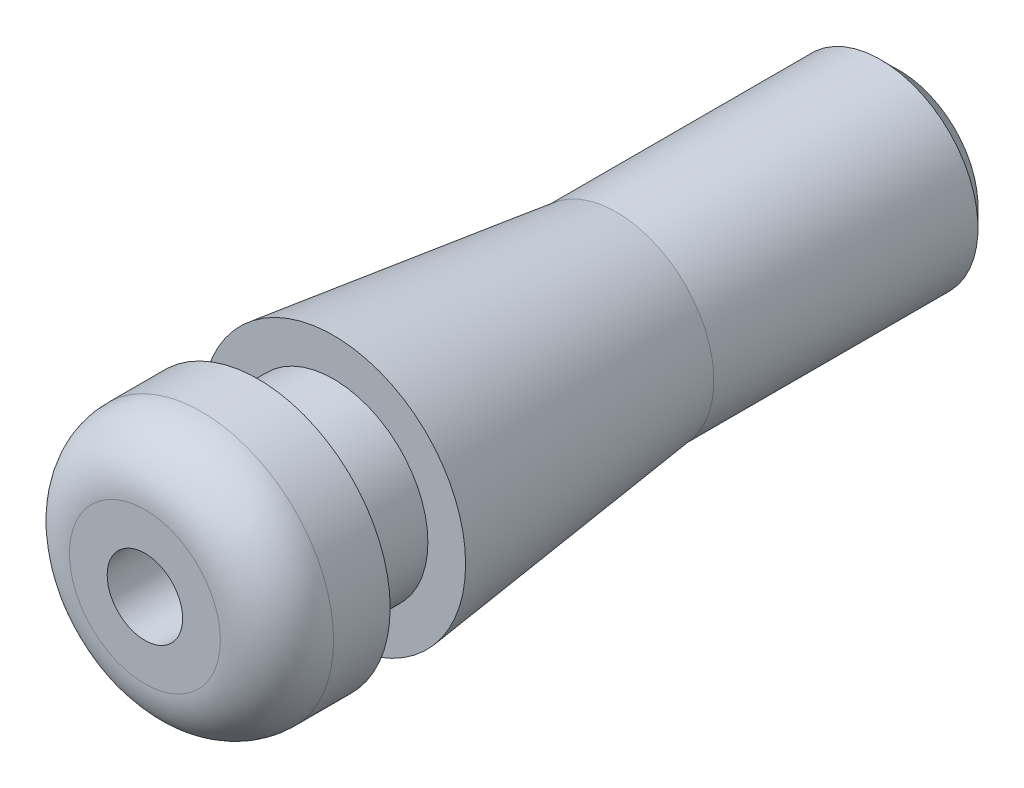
ISO-10303-21;
HEADER;
FILE_DESCRIPTION(('STEP AP214'),'2;1');
FILE_NAME('part.step','',(''),(''),'','','');
FILE_SCHEMA(('AUTOMOTIVE_DESIGN { 1 0 10303 214 1 1 1 1 }'));
ENDSEC;
DATA;
#1=APPLICATION_CONTEXT('core data for automotive mechanical design processes');
#2=APPLICATION_PROTOCOL_DEFINITION('international standard','automotive_design',2000,#1);
#3=PRODUCT_CONTEXT('',#1,'mechanical');
#4=PRODUCT('Part','Part','',(#3));
#5=PRODUCT_RELATED_PRODUCT_CATEGORY('part','',(#4));
#6=PRODUCT_DEFINITION_FORMATION('','',#4);
#7=PRODUCT_DEFINITION_CONTEXT('part definition',#1,'design');
#8=PRODUCT_DEFINITION('design','',#6,#7);
#9=PRODUCT_DEFINITION_SHAPE('','',#8);
#10=(LENGTH_UNIT() NAMED_UNIT(*) SI_UNIT(.MILLI.,.METRE.));
#11=(NAMED_UNIT(*) PLANE_ANGLE_UNIT() SI_UNIT($,.RADIAN.));
#12=(NAMED_UNIT(*) SI_UNIT($,.STERADIAN.) SOLID_ANGLE_UNIT());
#13=UNCERTAINTY_MEASURE_WITH_UNIT(LENGTH_MEASURE(1.E-05),#10,'distance_accuracy_value','');
#14=(GEOMETRIC_REPRESENTATION_CONTEXT(3) GLOBAL_UNCERTAINTY_ASSIGNED_CONTEXT((#13)) GLOBAL_UNIT_ASSIGNED_CONTEXT((#10,
#11,#12)) REPRESENTATION_CONTEXT('',''));
#15=CARTESIAN_POINT('',(0.,0.,0.));
#16=DIRECTION('',(0.,0.,1.));
#17=DIRECTION('',(1.,0.,0.));
#18=AXIS2_PLACEMENT_3D('',#15,#16,#17);
#19=CARTESIAN_POINT('',(0.,0.,4.));
#20=DIRECTION('',(0.,0.,-1.));
#21=DIRECTION('',(-1.,0.,0.));
#22=AXIS2_PLACEMENT_3D('',#19,#20,#21);
#23=CYLINDRICAL_SURFACE('',#22,5.);
#24=CARTESIAN_POINT('',(0.,0.,4.));
#25=DIRECTION('',(0.,0.,1.));
#26=DIRECTION('',(1.,0.,0.));
#27=AXIS2_PLACEMENT_3D('',#24,#25,#26);
#28=CIRCLE('',#27,5.);
#29=CARTESIAN_POINT('',(5.,0.,4.));
#30=VERTEX_POINT('',#29);
#31=EDGE_CURVE('E56',#30,#30,#28,.T.);
#32=ORIENTED_EDGE('',*,*,#31,.F.);
#33=EDGE_LOOP('',(#32));
#34=FACE_BOUND('',#33,.T.);
#35=CARTESIAN_POINT('',(0.,0.,0.));
#36=DIRECTION('',(0.,0.,1.));
#37=DIRECTION('',(1.,0.,0.));
#38=AXIS2_PLACEMENT_3D('',#35,#36,#37);
#39=CIRCLE('',#38,5.);
#40=CARTESIAN_POINT('',(5.,0.,0.));
#41=VERTEX_POINT('',#40);
#42=EDGE_CURVE('E60',#41,#41,#39,.T.);
#43=ORIENTED_EDGE('',*,*,#42,.T.);
#44=EDGE_LOOP('',(#43));
#45=FACE_BOUND('',#44,.T.);
#46=ADVANCED_FACE('F31',(#34,#45),#23,.T.);
#47=CARTESIAN_POINT('',(0.,0.,4.));
#48=DIRECTION('',(0.,0.,1.));
#49=DIRECTION('',(1.,0.,0.));
#50=AXIS2_PLACEMENT_3D('',#47,#48,#49);
#51=PLANE('',#50);
#52=CARTESIAN_POINT('',(0.,0.,4.));
#53=DIRECTION('',(0.,0.,1.));
#54=DIRECTION('',(1.,0.,0.));
#55=AXIS2_PLACEMENT_3D('',#52,#53,#54);
#56=CIRCLE('',#55,7.);
#57=CARTESIAN_POINT('',(7.,0.,4.));
#58=VERTEX_POINT('',#57);
#59=EDGE_CURVE('E59',#58,#58,#56,.T.);
#60=ORIENTED_EDGE('',*,*,#59,.F.);
#61=EDGE_LOOP('',(#60));
#62=FACE_BOUND('',#61,.T.);
#63=ORIENTED_EDGE('',*,*,#31,.T.);
#64=EDGE_LOOP('',(#63));
#65=FACE_BOUND('',#64,.T.);
#66=ADVANCED_FACE('F97',(#62,#65),#51,.F.);
#67=CARTESIAN_POINT('',(0.,0.,10.));
#68=DIRECTION('',(0.,0.,-1.));
#69=DIRECTION('',(-1.,0.,0.));
#70=AXIS2_PLACEMENT_3D('',#67,#68,#69);
#71=CYLINDRICAL_SURFACE('',#70,7.);
#72=CARTESIAN_POINT('',(0.,0.,7.));
#73=DIRECTION('',(0.,0.,1.));
#74=DIRECTION('',(1.,0.,0.));
#75=AXIS2_PLACEMENT_3D('',#72,#73,#74);
#76=CIRCLE('',#75,7.);
#77=CARTESIAN_POINT('',(7.,0.,7.));
#78=VERTEX_POINT('',#77);
#79=EDGE_CURVE('E50',#78,#78,#76,.F.);
#80=ORIENTED_EDGE('',*,*,#79,.T.);
#81=EDGE_LOOP('',(#80));
#82=FACE_BOUND('',#81,.T.);
#83=ORIENTED_EDGE('',*,*,#59,.T.);
#84=EDGE_LOOP('',(#83));
#85=FACE_BOUND('',#84,.T.);
#86=ADVANCED_FACE('F102',(#82,#85),#71,.T.);
#87=CARTESIAN_POINT('',(0.,0.,10.));
#88=DIRECTION('',(0.,0.,1.));
#89=DIRECTION('',(1.,0.,0.));
#90=AXIS2_PLACEMENT_3D('',#87,#88,#89);
#91=PLANE('',#90);
#92=CARTESIAN_POINT('',(0.,0.,10.));
#93=DIRECTION('',(0.,0.,-1.));
#94=DIRECTION('',(-1.,0.,0.));
#95=AXIS2_PLACEMENT_3D('',#92,#93,#94);
#96=CIRCLE('',#95,2.);
#97=CARTESIAN_POINT('',(-2.,0.,10.));
#98=VERTEX_POINT('',#97);
#99=EDGE_CURVE('E71',#98,#98,#96,.T.);
#100=ORIENTED_EDGE('',*,*,#99,.T.);
#101=EDGE_LOOP('',(#100));
#102=FACE_BOUND('',#101,.T.);
#103=CARTESIAN_POINT('',(0.,0.,10.));
#104=DIRECTION('',(0.,0.,1.));
#105=DIRECTION('',(1.,0.,0.));
#106=AXIS2_PLACEMENT_3D('',#103,#104,#105);
#107=CIRCLE('',#106,4.);
#108=CARTESIAN_POINT('',(4.,0.,10.));
#109=VERTEX_POINT('',#108);
#110=EDGE_CURVE('E53',#109,#109,#107,.T.);
#111=ORIENTED_EDGE('',*,*,#110,.T.);
#112=EDGE_LOOP('',(#111));
#113=FACE_BOUND('',#112,.T.);
#114=ADVANCED_FACE('F75',(#102,#113),#91,.T.);
#115=CARTESIAN_POINT('',(0.,0.,7.));
#116=DIRECTION('',(0.,0.,1.));
#117=DIRECTION('',(1.,0.,0.));
#118=AXIS2_PLACEMENT_3D('',#115,#116,#117);
#119=TOROIDAL_SURFACE('',#118,4.,3.);
#120=ORIENTED_EDGE('',*,*,#79,.F.);
#121=EDGE_LOOP('',(#120));
#122=FACE_BOUND('',#121,.T.);
#123=ORIENTED_EDGE('',*,*,#110,.F.);
#124=EDGE_LOOP('',(#123));
#125=FACE_BOUND('',#124,.T.);
#126=ADVANCED_FACE('F116',(#122,#125),#119,.T.);
#127=CARTESIAN_POINT('',(0.,0.,0.));
#128=DIRECTION('',(0.,0.,1.));
#129=DIRECTION('',(-1.,0.,0.));
#130=AXIS2_PLACEMENT_3D('',#127,#128,#129);
#131=CONICAL_SURFACE('',#130,7.,0.122173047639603);
#132=CARTESIAN_POINT('',(0.,0.,-15.));
#133=DIRECTION('',(0.,0.,-1.));
#134=DIRECTION('',(-1.,0.,0.));
#135=AXIS2_PLACEMENT_3D('',#132,#133,#134);
#136=CIRCLE('',#135,5.15823158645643);
#137=CARTESIAN_POINT('',(-5.15823158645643,0.,-15.));
#138=VERTEX_POINT('',#137);
#139=EDGE_CURVE('E63',#138,#138,#136,.T.);
#140=ORIENTED_EDGE('',*,*,#139,.F.);
#141=EDGE_LOOP('',(#140));
#142=FACE_BOUND('',#141,.T.);
#143=CARTESIAN_POINT('',(0.,0.,0.));
#144=DIRECTION('',(0.,0.,-1.));
#145=DIRECTION('',(-1.,0.,0.));
#146=AXIS2_PLACEMENT_3D('',#143,#144,#145);
#147=CIRCLE('',#146,7.);
#148=CARTESIAN_POINT('',(-7.,0.,0.));
#149=VERTEX_POINT('',#148);
#150=EDGE_CURVE('E68',#149,#149,#147,.T.);
#151=ORIENTED_EDGE('',*,*,#150,.T.);
#152=EDGE_LOOP('',(#151));
#153=FACE_BOUND('',#152,.T.);
#154=ADVANCED_FACE('F111',(#142,#153),#131,.T.);
#155=CARTESIAN_POINT('',(0.,0.,0.));
#156=DIRECTION('',(0.,0.,-1.));
#157=DIRECTION('',(-1.,0.,0.));
#158=AXIS2_PLACEMENT_3D('',#155,#156,#157);
#159=PLANE('',#158);
#160=ORIENTED_EDGE('',*,*,#42,.F.);
#161=EDGE_LOOP('',(#160));
#162=FACE_BOUND('',#161,.T.);
#163=ORIENTED_EDGE('',*,*,#150,.F.);
#164=EDGE_LOOP('',(#163));
#165=FACE_BOUND('',#164,.T.);
#166=ADVANCED_FACE('F93',(#162,#165),#159,.F.);
#167=CARTESIAN_POINT('',(0.,0.,-30.));
#168=DIRECTION('',(0.,0.,1.));
#169=DIRECTION('',(1.,0.,0.));
#170=AXIS2_PLACEMENT_3D('',#167,#168,#169);
#171=CYLINDRICAL_SURFACE('',#170,5.15823158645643);
#172=CARTESIAN_POINT('',(0.,0.,-29.));
#173=DIRECTION('',(0.,0.,-1.));
#174=DIRECTION('',(-1.,0.,0.));
#175=AXIS2_PLACEMENT_3D('',#172,#173,#174);
#176=CIRCLE('',#175,5.15823158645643);
#177=CARTESIAN_POINT('',(-5.15823158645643,0.,-29.));
#178=VERTEX_POINT('',#177);
#179=EDGE_CURVE('E37',#178,#178,#176,.F.);
#180=ORIENTED_EDGE('',*,*,#179,.T.);
#181=EDGE_LOOP('',(#180));
#182=FACE_BOUND('',#181,.T.);
#183=ORIENTED_EDGE('',*,*,#139,.T.);
#184=EDGE_LOOP('',(#183));
#185=FACE_BOUND('',#184,.T.);
#186=ADVANCED_FACE('F83',(#182,#185),#171,.T.);
#187=CARTESIAN_POINT('',(0.,0.,-30.));
#188=DIRECTION('',(0.,0.,-1.));
#189=DIRECTION('',(-1.,0.,0.));
#190=AXIS2_PLACEMENT_3D('',#187,#188,#189);
#191=PLANE('',#190);
#192=CARTESIAN_POINT('',(0.,0.,-30.));
#193=DIRECTION('',(0.,0.,-1.));
#194=DIRECTION('',(-1.,0.,0.));
#195=AXIS2_PLACEMENT_3D('',#192,#193,#194);
#196=CIRCLE('',#195,4.15823158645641);
#197=CARTESIAN_POINT('',(-4.15823158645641,0.,-30.));
#198=VERTEX_POINT('',#197);
#199=EDGE_CURVE('E41',#198,#198,#196,.T.);
#200=ORIENTED_EDGE('',*,*,#199,.T.);
#201=EDGE_LOOP('',(#200));
#202=FACE_BOUND('',#201,.T.);
#203=CARTESIAN_POINT('',(0.,0.,-30.));
#204=DIRECTION('',(0.,0.,-1.));
#205=DIRECTION('',(-1.,0.,0.));
#206=AXIS2_PLACEMENT_3D('',#203,#204,#205);
#207=CIRCLE('',#206,3.00000000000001);
#208=CARTESIAN_POINT('',(-3.00000000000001,0.,-30.));
#209=VERTEX_POINT('',#208);
#210=EDGE_CURVE('E45',#209,#209,#207,.F.);
#211=ORIENTED_EDGE('',*,*,#210,.T.);
#212=EDGE_LOOP('',(#211));
#213=FACE_BOUND('',#212,.T.);
#214=ADVANCED_FACE('F81',(#202,#213),#191,.T.);
#215=CARTESIAN_POINT('',(0.,0.,10.));
#216=DIRECTION('',(0.,0.,-1.));
#217=DIRECTION('',(-1.,0.,0.));
#218=AXIS2_PLACEMENT_3D('',#215,#216,#217);
#219=CYLINDRICAL_SURFACE('',#218,2.);
#220=CARTESIAN_POINT('',(0.,0.,-29.));
#221=DIRECTION('',(0.,0.,-1.));
#222=DIRECTION('',(-1.,0.,0.));
#223=AXIS2_PLACEMENT_3D('',#220,#221,#222);
#224=CIRCLE('',#223,2.);
#225=CARTESIAN_POINT('',(-2.,0.,-29.));
#226=VERTEX_POINT('',#225);
#227=EDGE_CURVE('E10',#226,#226,#224,.T.);
#228=ORIENTED_EDGE('',*,*,#227,.T.);
#229=EDGE_LOOP('',(#228));
#230=FACE_BOUND('',#229,.T.);
#231=ORIENTED_EDGE('',*,*,#99,.F.);
#232=EDGE_LOOP('',(#231));
#233=FACE_BOUND('',#232,.T.);
#234=ADVANCED_FACE('F78',(#230,#233),#219,.F.);
#235=CARTESIAN_POINT('',(0.,0.,-30.));
#236=DIRECTION('',(0.,0.,1.));
#237=DIRECTION('',(1.,0.,0.));
#238=AXIS2_PLACEMENT_3D('',#235,#236,#237);
#239=CONICAL_SURFACE('',#238,4.15823158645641,0.785398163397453);
#240=ORIENTED_EDGE('',*,*,#179,.F.);
#241=EDGE_LOOP('',(#240));
#242=FACE_BOUND('',#241,.T.);
#243=ORIENTED_EDGE('',*,*,#199,.F.);
#244=EDGE_LOOP('',(#243));
#245=FACE_BOUND('',#244,.T.);
#246=ADVANCED_FACE('F80',(#242,#245),#239,.T.);
#247=CARTESIAN_POINT('',(0.,0.,-29.));
#248=DIRECTION('',(0.,0.,-1.));
#249=DIRECTION('',(-1.,0.,0.));
#250=AXIS2_PLACEMENT_3D('',#247,#248,#249);
#251=CONICAL_SURFACE('',#250,2.,0.785398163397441);
#252=ORIENTED_EDGE('',*,*,#210,.F.);
#253=EDGE_LOOP('',(#252));
#254=FACE_BOUND('',#253,.T.);
#255=ORIENTED_EDGE('',*,*,#227,.F.);
#256=EDGE_LOOP('',(#255));
#257=FACE_BOUND('',#256,.T.);
#258=ADVANCED_FACE('F88',(#254,#257),#251,.F.);
#259=CLOSED_SHELL('',(#46,#66,#86,#114,#126,#154,#166,#186,#214,#234,#246,#258));
#260=MANIFOLD_SOLID_BREP('B2',#259);
#261=ADVANCED_BREP_SHAPE_REPRESENTATION('',(#18,#260),#14);
#262=SHAPE_DEFINITION_REPRESENTATION(#9,#261);
ENDSEC;
END-ISO-10303-21;
